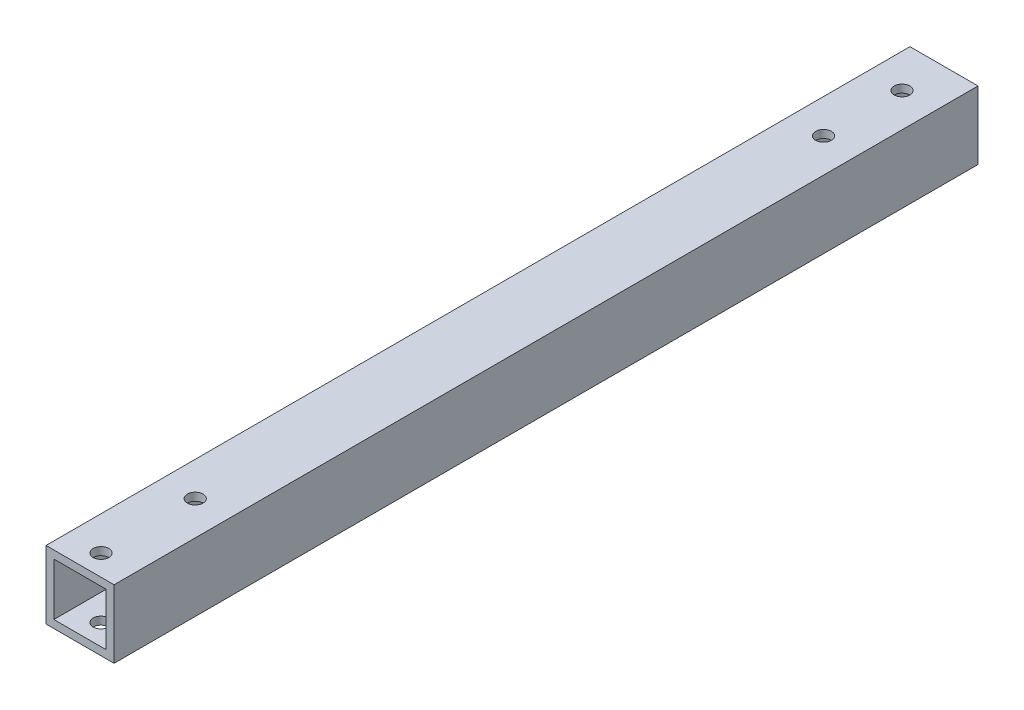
ISO-10303-21;
HEADER;
FILE_DESCRIPTION(('STEP AP214'),'2;1');
FILE_NAME('part.step','',(''),(''),'','','');
FILE_SCHEMA(('AUTOMOTIVE_DESIGN { 1 0 10303 214 1 1 1 1 }'));
ENDSEC;
DATA;
#1=APPLICATION_CONTEXT('core data for automotive mechanical design processes');
#2=APPLICATION_PROTOCOL_DEFINITION('international standard','automotive_design',2000,#1);
#3=PRODUCT_CONTEXT('',#1,'mechanical');
#4=PRODUCT('Part','Part','',(#3));
#5=PRODUCT_RELATED_PRODUCT_CATEGORY('part','',(#4));
#6=PRODUCT_DEFINITION_FORMATION('','',#4);
#7=PRODUCT_DEFINITION_CONTEXT('part definition',#1,'design');
#8=PRODUCT_DEFINITION('design','',#6,#7);
#9=PRODUCT_DEFINITION_SHAPE('','',#8);
#10=(LENGTH_UNIT() NAMED_UNIT(*) SI_UNIT(.MILLI.,.METRE.));
#11=(NAMED_UNIT(*) PLANE_ANGLE_UNIT() SI_UNIT($,.RADIAN.));
#12=(NAMED_UNIT(*) SI_UNIT($,.STERADIAN.) SOLID_ANGLE_UNIT());
#13=UNCERTAINTY_MEASURE_WITH_UNIT(LENGTH_MEASURE(1.E-05),#10,'distance_accuracy_value','');
#14=(GEOMETRIC_REPRESENTATION_CONTEXT(3) GLOBAL_UNCERTAINTY_ASSIGNED_CONTEXT((#13)) GLOBAL_UNIT_ASSIGNED_CONTEXT((#10,
#11,#12)) REPRESENTATION_CONTEXT('',''));
#15=CARTESIAN_POINT('',(0.,0.,0.));
#16=DIRECTION('',(0.,0.,1.));
#17=DIRECTION('',(1.,0.,0.));
#18=AXIS2_PLACEMENT_3D('',#15,#16,#17);
#19=CARTESIAN_POINT('',(6.5,6.5,165.));
#20=DIRECTION('',(-1.,0.,0.));
#21=DIRECTION('',(0.,-1.,0.));
#22=AXIS2_PLACEMENT_3D('',#19,#20,#21);
#23=PLANE('',#22);
#24=DIRECTION('',(0.,1.,0.));
#25=VECTOR('',#24,1.);
#26=CARTESIAN_POINT('',(6.5,6.5,0.));
#27=LINE('',#26,#25);
#28=CARTESIAN_POINT('',(6.5,-6.5,0.));
#29=VERTEX_POINT('',#28);
#30=CARTESIAN_POINT('',(6.5,6.5,0.));
#31=VERTEX_POINT('',#30);
#32=EDGE_CURVE('E148',#29,#31,#27,.T.);
#33=ORIENTED_EDGE('',*,*,#32,.T.);
#34=DIRECTION('',(0.,0.,-1.));
#35=VECTOR('',#34,1.);
#36=CARTESIAN_POINT('',(6.5,6.5,165.));
#37=LINE('',#36,#35);
#38=CARTESIAN_POINT('',(6.5,6.5,165.));
#39=VERTEX_POINT('',#38);
#40=EDGE_CURVE('E11',#39,#31,#37,.T.);
#41=ORIENTED_EDGE('',*,*,#40,.F.);
#42=DIRECTION('',(0.,1.,0.));
#43=VECTOR('',#42,1.);
#44=CARTESIAN_POINT('',(6.5,6.5,165.));
#45=LINE('',#44,#43);
#46=CARTESIAN_POINT('',(6.5,-6.5,165.));
#47=VERTEX_POINT('',#46);
#48=EDGE_CURVE('E137',#47,#39,#45,.T.);
#49=ORIENTED_EDGE('',*,*,#48,.F.);
#50=DIRECTION('',(0.,0.,-1.));
#51=VECTOR('',#50,1.);
#52=CARTESIAN_POINT('',(6.5,-6.5,165.));
#53=LINE('',#52,#51);
#54=EDGE_CURVE('E147',#47,#29,#53,.T.);
#55=ORIENTED_EDGE('',*,*,#54,.T.);
#56=EDGE_LOOP('',(#33,#41,#49,#55));
#57=FACE_BOUND('',#56,.T.);
#58=ADVANCED_FACE('F37',(#57),#23,.F.);
#59=CARTESIAN_POINT('',(-6.5,6.5,165.));
#60=DIRECTION('',(0.,-1.,0.));
#61=DIRECTION('',(0.,0.,-1.));
#62=AXIS2_PLACEMENT_3D('',#59,#60,#61);
#63=PLANE('',#62);
#64=CARTESIAN_POINT('',(0.,6.5,143.));
#65=DIRECTION('',(0.,1.,0.));
#66=DIRECTION('',(0.,0.,1.));
#67=AXIS2_PLACEMENT_3D('',#64,#65,#66);
#68=CIRCLE('',#67,1.5);
#69=CARTESIAN_POINT('',(0.,6.5,144.5));
#70=VERTEX_POINT('',#69);
#71=EDGE_CURVE('E311',#70,#70,#68,.T.);
#72=ORIENTED_EDGE('',*,*,#71,.F.);
#73=EDGE_LOOP('',(#72));
#74=FACE_BOUND('',#73,.T.);
#75=CARTESIAN_POINT('',(0.,6.5,161.));
#76=DIRECTION('',(0.,1.,0.));
#77=DIRECTION('',(0.,0.,1.));
#78=AXIS2_PLACEMENT_3D('',#75,#76,#77);
#79=CIRCLE('',#78,1.5);
#80=CARTESIAN_POINT('',(0.,6.5,162.5));
#81=VERTEX_POINT('',#80);
#82=EDGE_CURVE('E181',#81,#81,#79,.T.);
#83=ORIENTED_EDGE('',*,*,#82,.F.);
#84=EDGE_LOOP('',(#83));
#85=FACE_BOUND('',#84,.T.);
#86=CARTESIAN_POINT('',(0.,6.5,23.));
#87=DIRECTION('',(0.,1.,0.));
#88=DIRECTION('',(0.,0.,1.));
#89=AXIS2_PLACEMENT_3D('',#86,#87,#88);
#90=CIRCLE('',#89,1.5);
#91=CARTESIAN_POINT('',(0.,6.5,24.5));
#92=VERTEX_POINT('',#91);
#93=EDGE_CURVE('E178',#92,#92,#90,.T.);
#94=ORIENTED_EDGE('',*,*,#93,.F.);
#95=EDGE_LOOP('',(#94));
#96=FACE_BOUND('',#95,.T.);
#97=CARTESIAN_POINT('',(0.,6.5,8.));
#98=DIRECTION('',(0.,1.,0.));
#99=DIRECTION('',(0.,0.,1.));
#100=AXIS2_PLACEMENT_3D('',#97,#98,#99);
#101=CIRCLE('',#100,1.5);
#102=CARTESIAN_POINT('',(0.,6.5,9.5));
#103=VERTEX_POINT('',#102);
#104=EDGE_CURVE('E197',#103,#103,#101,.T.);
#105=ORIENTED_EDGE('',*,*,#104,.F.);
#106=EDGE_LOOP('',(#105));
#107=FACE_BOUND('',#106,.T.);
#108=DIRECTION('',(-1.,0.,0.));
#109=VECTOR('',#108,1.);
#110=CARTESIAN_POINT('',(-6.5,6.5,0.));
#111=LINE('',#110,#109);
#112=CARTESIAN_POINT('',(-6.5,6.5,0.));
#113=VERTEX_POINT('',#112);
#114=EDGE_CURVE('E151',#31,#113,#111,.T.);
#115=ORIENTED_EDGE('',*,*,#114,.T.);
#116=DIRECTION('',(0.,0.,-1.));
#117=VECTOR('',#116,1.);
#118=CARTESIAN_POINT('',(-6.5,6.5,165.));
#119=LINE('',#118,#117);
#120=CARTESIAN_POINT('',(-6.5,6.5,165.));
#121=VERTEX_POINT('',#120);
#122=EDGE_CURVE('E45',#121,#113,#119,.T.);
#123=ORIENTED_EDGE('',*,*,#122,.F.);
#124=DIRECTION('',(-1.,0.,0.));
#125=VECTOR('',#124,1.);
#126=CARTESIAN_POINT('',(-6.5,6.5,165.));
#127=LINE('',#126,#125);
#128=EDGE_CURVE('E140',#39,#121,#127,.T.);
#129=ORIENTED_EDGE('',*,*,#128,.F.);
#130=ORIENTED_EDGE('',*,*,#40,.T.);
#131=EDGE_LOOP('',(#115,#123,#129,#130));
#132=FACE_BOUND('',#131,.T.);
#133=ADVANCED_FACE('F226',(#74,#85,#96,#107,#132),#63,.F.);
#134=CARTESIAN_POINT('',(-6.5,6.5,165.));
#135=DIRECTION('',(1.,0.,0.));
#136=DIRECTION('',(0.,1.,0.));
#137=AXIS2_PLACEMENT_3D('',#134,#135,#136);
#138=PLANE('',#137);
#139=DIRECTION('',(0.,-1.,0.));
#140=VECTOR('',#139,1.);
#141=CARTESIAN_POINT('',(-6.5,6.5,0.));
#142=LINE('',#141,#140);
#143=CARTESIAN_POINT('',(-6.5,-6.5,0.));
#144=VERTEX_POINT('',#143);
#145=EDGE_CURVE('E153',#113,#144,#142,.T.);
#146=ORIENTED_EDGE('',*,*,#145,.T.);
#147=DIRECTION('',(0.,0.,-1.));
#148=VECTOR('',#147,1.);
#149=CARTESIAN_POINT('',(-6.5,-6.5,165.));
#150=LINE('',#149,#148);
#151=CARTESIAN_POINT('',(-6.5,-6.5,165.));
#152=VERTEX_POINT('',#151);
#153=EDGE_CURVE('E158',#152,#144,#150,.T.);
#154=ORIENTED_EDGE('',*,*,#153,.F.);
#155=DIRECTION('',(0.,-1.,0.));
#156=VECTOR('',#155,1.);
#157=CARTESIAN_POINT('',(-6.5,6.5,165.));
#158=LINE('',#157,#156);
#159=EDGE_CURVE('E143',#121,#152,#158,.T.);
#160=ORIENTED_EDGE('',*,*,#159,.F.);
#161=ORIENTED_EDGE('',*,*,#122,.T.);
#162=EDGE_LOOP('',(#146,#154,#160,#161));
#163=FACE_BOUND('',#162,.T.);
#164=ADVANCED_FACE('F231',(#163),#138,.F.);
#165=CARTESIAN_POINT('',(-6.5,-6.5,165.));
#166=DIRECTION('',(0.,1.,0.));
#167=DIRECTION('',(0.,0.,1.));
#168=AXIS2_PLACEMENT_3D('',#165,#166,#167);
#169=PLANE('',#168);
#170=CARTESIAN_POINT('',(0.,-6.5,143.));
#171=DIRECTION('',(0.,1.,0.));
#172=DIRECTION('',(0.,0.,1.));
#173=AXIS2_PLACEMENT_3D('',#170,#171,#172);
#174=CIRCLE('',#173,1.5);
#175=CARTESIAN_POINT('',(0.,-6.5,144.5));
#176=VERTEX_POINT('',#175);
#177=EDGE_CURVE('E310',#176,#176,#174,.T.);
#178=ORIENTED_EDGE('',*,*,#177,.T.);
#179=EDGE_LOOP('',(#178));
#180=FACE_BOUND('',#179,.T.);
#181=CARTESIAN_POINT('',(0.,-6.5,161.));
#182=DIRECTION('',(0.,1.,0.));
#183=DIRECTION('',(0.,0.,1.));
#184=AXIS2_PLACEMENT_3D('',#181,#182,#183);
#185=CIRCLE('',#184,1.5);
#186=CARTESIAN_POINT('',(0.,-6.5,162.5));
#187=VERTEX_POINT('',#186);
#188=EDGE_CURVE('E174',#187,#187,#185,.T.);
#189=ORIENTED_EDGE('',*,*,#188,.T.);
#190=EDGE_LOOP('',(#189));
#191=FACE_BOUND('',#190,.T.);
#192=CARTESIAN_POINT('',(0.,-6.5,23.));
#193=DIRECTION('',(0.,1.,0.));
#194=DIRECTION('',(0.,0.,1.));
#195=AXIS2_PLACEMENT_3D('',#192,#193,#194);
#196=CIRCLE('',#195,1.5);
#197=CARTESIAN_POINT('',(0.,-6.5,24.5));
#198=VERTEX_POINT('',#197);
#199=EDGE_CURVE('E170',#198,#198,#196,.T.);
#200=ORIENTED_EDGE('',*,*,#199,.T.);
#201=EDGE_LOOP('',(#200));
#202=FACE_BOUND('',#201,.T.);
#203=CARTESIAN_POINT('',(0.,-6.5,8.));
#204=DIRECTION('',(0.,1.,0.));
#205=DIRECTION('',(0.,0.,1.));
#206=AXIS2_PLACEMENT_3D('',#203,#204,#205);
#207=CIRCLE('',#206,1.5);
#208=CARTESIAN_POINT('',(0.,-6.5,9.5));
#209=VERTEX_POINT('',#208);
#210=EDGE_CURVE('E166',#209,#209,#207,.T.);
#211=ORIENTED_EDGE('',*,*,#210,.T.);
#212=EDGE_LOOP('',(#211));
#213=FACE_BOUND('',#212,.T.);
#214=DIRECTION('',(1.,0.,0.));
#215=VECTOR('',#214,1.);
#216=CARTESIAN_POINT('',(-6.5,-6.5,0.));
#217=LINE('',#216,#215);
#218=EDGE_CURVE('E141',#144,#29,#217,.T.);
#219=ORIENTED_EDGE('',*,*,#218,.T.);
#220=ORIENTED_EDGE('',*,*,#54,.F.);
#221=DIRECTION('',(1.,0.,0.));
#222=VECTOR('',#221,1.);
#223=CARTESIAN_POINT('',(-6.5,-6.5,165.));
#224=LINE('',#223,#222);
#225=EDGE_CURVE('E145',#152,#47,#224,.T.);
#226=ORIENTED_EDGE('',*,*,#225,.F.);
#227=ORIENTED_EDGE('',*,*,#153,.T.);
#228=EDGE_LOOP('',(#219,#220,#226,#227));
#229=FACE_BOUND('',#228,.T.);
#230=ADVANCED_FACE('F245',(#180,#191,#202,#213,#229),#169,.F.);
#231=CARTESIAN_POINT('',(0.,0.,165.));
#232=DIRECTION('',(0.,0.,1.));
#233=DIRECTION('',(1.,0.,0.));
#234=AXIS2_PLACEMENT_3D('',#231,#232,#233);
#235=PLANE('',#234);
#236=DIRECTION('',(0.,1.,0.));
#237=VECTOR('',#236,1.);
#238=CARTESIAN_POINT('',(5.,6.5,165.));
#239=LINE('',#238,#237);
#240=CARTESIAN_POINT('',(5.,-5.,165.));
#241=VERTEX_POINT('',#240);
#242=CARTESIAN_POINT('',(5.,5.,165.));
#243=VERTEX_POINT('',#242);
#244=EDGE_CURVE('E125',#241,#243,#239,.T.);
#245=ORIENTED_EDGE('',*,*,#244,.F.);
#246=DIRECTION('',(1.,0.,0.));
#247=VECTOR('',#246,1.);
#248=CARTESIAN_POINT('',(-6.5,-5.,165.));
#249=LINE('',#248,#247);
#250=CARTESIAN_POINT('',(-5.,-5.,165.));
#251=VERTEX_POINT('',#250);
#252=EDGE_CURVE('E108',#251,#241,#249,.T.);
#253=ORIENTED_EDGE('',*,*,#252,.F.);
#254=DIRECTION('',(0.,-1.,0.));
#255=VECTOR('',#254,1.);
#256=CARTESIAN_POINT('',(-5.,6.5,165.));
#257=LINE('',#256,#255);
#258=CARTESIAN_POINT('',(-5.,5.,165.));
#259=VERTEX_POINT('',#258);
#260=EDGE_CURVE('E134',#259,#251,#257,.T.);
#261=ORIENTED_EDGE('',*,*,#260,.F.);
#262=DIRECTION('',(-1.,0.,0.));
#263=VECTOR('',#262,1.);
#264=CARTESIAN_POINT('',(-6.5,5.,165.));
#265=LINE('',#264,#263);
#266=EDGE_CURVE('E127',#243,#259,#265,.T.);
#267=ORIENTED_EDGE('',*,*,#266,.F.);
#268=EDGE_LOOP('',(#245,#253,#261,#267));
#269=FACE_BOUND('',#268,.T.);
#270=ORIENTED_EDGE('',*,*,#48,.T.);
#271=ORIENTED_EDGE('',*,*,#128,.T.);
#272=ORIENTED_EDGE('',*,*,#159,.T.);
#273=ORIENTED_EDGE('',*,*,#225,.T.);
#274=EDGE_LOOP('',(#270,#271,#272,#273));
#275=FACE_BOUND('',#274,.T.);
#276=ADVANCED_FACE('F210',(#269,#275),#235,.T.);
#277=CARTESIAN_POINT('',(0.,0.,0.));
#278=DIRECTION('',(0.,0.,1.));
#279=DIRECTION('',(1.,0.,0.));
#280=AXIS2_PLACEMENT_3D('',#277,#278,#279);
#281=PLANE('',#280);
#282=DIRECTION('',(1.,0.,0.));
#283=VECTOR('',#282,1.);
#284=CARTESIAN_POINT('',(-6.5,-5.,0.));
#285=LINE('',#284,#283);
#286=CARTESIAN_POINT('',(-5.,-5.,0.));
#287=VERTEX_POINT('',#286);
#288=CARTESIAN_POINT('',(5.,-5.,0.));
#289=VERTEX_POINT('',#288);
#290=EDGE_CURVE('E106',#287,#289,#285,.T.);
#291=ORIENTED_EDGE('',*,*,#290,.T.);
#292=DIRECTION('',(0.,1.,0.));
#293=VECTOR('',#292,1.);
#294=CARTESIAN_POINT('',(5.,6.5,0.));
#295=LINE('',#294,#293);
#296=CARTESIAN_POINT('',(5.,5.,0.));
#297=VERTEX_POINT('',#296);
#298=EDGE_CURVE('E114',#289,#297,#295,.T.);
#299=ORIENTED_EDGE('',*,*,#298,.T.);
#300=DIRECTION('',(-1.,0.,0.));
#301=VECTOR('',#300,1.);
#302=CARTESIAN_POINT('',(-6.5,5.,0.));
#303=LINE('',#302,#301);
#304=CARTESIAN_POINT('',(-5.,5.,0.));
#305=VERTEX_POINT('',#304);
#306=EDGE_CURVE('E120',#297,#305,#303,.T.);
#307=ORIENTED_EDGE('',*,*,#306,.T.);
#308=DIRECTION('',(0.,-1.,0.));
#309=VECTOR('',#308,1.);
#310=CARTESIAN_POINT('',(-5.,6.5,0.));
#311=LINE('',#310,#309);
#312=EDGE_CURVE('E60',#305,#287,#311,.T.);
#313=ORIENTED_EDGE('',*,*,#312,.T.);
#314=EDGE_LOOP('',(#291,#299,#307,#313));
#315=FACE_BOUND('',#314,.T.);
#316=ORIENTED_EDGE('',*,*,#32,.F.);
#317=ORIENTED_EDGE('',*,*,#218,.F.);
#318=ORIENTED_EDGE('',*,*,#145,.F.);
#319=ORIENTED_EDGE('',*,*,#114,.F.);
#320=EDGE_LOOP('',(#316,#317,#318,#319));
#321=FACE_BOUND('',#320,.T.);
#322=ADVANCED_FACE('F123',(#315,#321),#281,.F.);
#323=CARTESIAN_POINT('',(5.,6.5,165.));
#324=DIRECTION('',(-1.,0.,0.));
#325=DIRECTION('',(0.,-1.,0.));
#326=AXIS2_PLACEMENT_3D('',#323,#324,#325);
#327=PLANE('',#326);
#328=ORIENTED_EDGE('',*,*,#298,.F.);
#329=DIRECTION('',(0.,0.,-1.));
#330=VECTOR('',#329,1.);
#331=CARTESIAN_POINT('',(5.,-5.,165.));
#332=LINE('',#331,#330);
#333=EDGE_CURVE('E102',#241,#289,#332,.T.);
#334=ORIENTED_EDGE('',*,*,#333,.F.);
#335=ORIENTED_EDGE('',*,*,#244,.T.);
#336=DIRECTION('',(0.,0.,-1.));
#337=VECTOR('',#336,1.);
#338=CARTESIAN_POINT('',(5.,5.,165.));
#339=LINE('',#338,#337);
#340=EDGE_CURVE('E117',#243,#297,#339,.T.);
#341=ORIENTED_EDGE('',*,*,#340,.T.);
#342=EDGE_LOOP('',(#328,#334,#335,#341));
#343=FACE_BOUND('',#342,.T.);
#344=ADVANCED_FACE('F115',(#343),#327,.T.);
#345=CARTESIAN_POINT('',(-6.5,5.,165.));
#346=DIRECTION('',(0.,-1.,0.));
#347=DIRECTION('',(0.,0.,-1.));
#348=AXIS2_PLACEMENT_3D('',#345,#346,#347);
#349=PLANE('',#348);
#350=CARTESIAN_POINT('',(0.,5.,143.));
#351=DIRECTION('',(0.,-1.,0.));
#352=DIRECTION('',(0.,0.,-1.));
#353=AXIS2_PLACEMENT_3D('',#350,#351,#352);
#354=CIRCLE('',#353,1.5);
#355=CARTESIAN_POINT('',(0.,5.,144.5));
#356=VERTEX_POINT('',#355);
#357=EDGE_CURVE('E186',#356,#356,#354,.T.);
#358=ORIENTED_EDGE('',*,*,#357,.F.);
#359=EDGE_LOOP('',(#358));
#360=FACE_BOUND('',#359,.T.);
#361=CARTESIAN_POINT('',(0.,5.,161.));
#362=DIRECTION('',(0.,-1.,0.));
#363=DIRECTION('',(0.,0.,-1.));
#364=AXIS2_PLACEMENT_3D('',#361,#362,#363);
#365=CIRCLE('',#364,1.5);
#366=CARTESIAN_POINT('',(0.,5.,162.5));
#367=VERTEX_POINT('',#366);
#368=EDGE_CURVE('E173',#367,#367,#365,.T.);
#369=ORIENTED_EDGE('',*,*,#368,.F.);
#370=EDGE_LOOP('',(#369));
#371=FACE_BOUND('',#370,.T.);
#372=CARTESIAN_POINT('',(0.,5.,23.));
#373=DIRECTION('',(0.,-1.,0.));
#374=DIRECTION('',(0.,0.,-1.));
#375=AXIS2_PLACEMENT_3D('',#372,#373,#374);
#376=CIRCLE('',#375,1.5);
#377=CARTESIAN_POINT('',(0.,5.,24.5));
#378=VERTEX_POINT('',#377);
#379=EDGE_CURVE('E169',#378,#378,#376,.T.);
#380=ORIENTED_EDGE('',*,*,#379,.F.);
#381=EDGE_LOOP('',(#380));
#382=FACE_BOUND('',#381,.T.);
#383=CARTESIAN_POINT('',(0.,5.,8.));
#384=DIRECTION('',(0.,-1.,0.));
#385=DIRECTION('',(0.,0.,-1.));
#386=AXIS2_PLACEMENT_3D('',#383,#384,#385);
#387=CIRCLE('',#386,1.5);
#388=CARTESIAN_POINT('',(0.,5.,9.5));
#389=VERTEX_POINT('',#388);
#390=EDGE_CURVE('E121',#389,#389,#387,.T.);
#391=ORIENTED_EDGE('',*,*,#390,.F.);
#392=EDGE_LOOP('',(#391));
#393=FACE_BOUND('',#392,.T.);
#394=ORIENTED_EDGE('',*,*,#306,.F.);
#395=ORIENTED_EDGE('',*,*,#340,.F.);
#396=ORIENTED_EDGE('',*,*,#266,.T.);
#397=DIRECTION('',(0.,0.,-1.));
#398=VECTOR('',#397,1.);
#399=CARTESIAN_POINT('',(-5.,5.,165.));
#400=LINE('',#399,#398);
#401=EDGE_CURVE('E204',#259,#305,#400,.T.);
#402=ORIENTED_EDGE('',*,*,#401,.T.);
#403=EDGE_LOOP('',(#394,#395,#396,#402));
#404=FACE_BOUND('',#403,.T.);
#405=ADVANCED_FACE('F213',(#360,#371,#382,#393,#404),#349,.T.);
#406=CARTESIAN_POINT('',(-5.,6.5,165.));
#407=DIRECTION('',(1.,0.,0.));
#408=DIRECTION('',(0.,1.,0.));
#409=AXIS2_PLACEMENT_3D('',#406,#407,#408);
#410=PLANE('',#409);
#411=ORIENTED_EDGE('',*,*,#312,.F.);
#412=ORIENTED_EDGE('',*,*,#401,.F.);
#413=ORIENTED_EDGE('',*,*,#260,.T.);
#414=DIRECTION('',(0.,0.,-1.));
#415=VECTOR('',#414,1.);
#416=CARTESIAN_POINT('',(-5.,-5.,165.));
#417=LINE('',#416,#415);
#418=EDGE_CURVE('E53',#251,#287,#417,.T.);
#419=ORIENTED_EDGE('',*,*,#418,.T.);
#420=EDGE_LOOP('',(#411,#412,#413,#419));
#421=FACE_BOUND('',#420,.T.);
#422=ADVANCED_FACE('F206',(#421),#410,.T.);
#423=CARTESIAN_POINT('',(-6.5,-5.,165.));
#424=DIRECTION('',(0.,1.,0.));
#425=DIRECTION('',(0.,0.,1.));
#426=AXIS2_PLACEMENT_3D('',#423,#424,#425);
#427=PLANE('',#426);
#428=CARTESIAN_POINT('',(0.,-5.,143.));
#429=DIRECTION('',(0.,1.,0.));
#430=DIRECTION('',(0.,0.,1.));
#431=AXIS2_PLACEMENT_3D('',#428,#429,#430);
#432=CIRCLE('',#431,1.5);
#433=CARTESIAN_POINT('',(0.,-5.,144.5));
#434=VERTEX_POINT('',#433);
#435=EDGE_CURVE('E40',#434,#434,#432,.T.);
#436=ORIENTED_EDGE('',*,*,#435,.F.);
#437=EDGE_LOOP('',(#436));
#438=FACE_BOUND('',#437,.T.);
#439=CARTESIAN_POINT('',(0.,-5.,161.));
#440=DIRECTION('',(0.,1.,0.));
#441=DIRECTION('',(0.,0.,1.));
#442=AXIS2_PLACEMENT_3D('',#439,#440,#441);
#443=CIRCLE('',#442,1.5);
#444=CARTESIAN_POINT('',(0.,-5.,162.5));
#445=VERTEX_POINT('',#444);
#446=EDGE_CURVE('E171',#445,#445,#443,.T.);
#447=ORIENTED_EDGE('',*,*,#446,.F.);
#448=EDGE_LOOP('',(#447));
#449=FACE_BOUND('',#448,.T.);
#450=CARTESIAN_POINT('',(0.,-5.,23.));
#451=DIRECTION('',(0.,1.,0.));
#452=DIRECTION('',(0.,0.,1.));
#453=AXIS2_PLACEMENT_3D('',#450,#451,#452);
#454=CIRCLE('',#453,1.5);
#455=CARTESIAN_POINT('',(0.,-5.,24.5));
#456=VERTEX_POINT('',#455);
#457=EDGE_CURVE('E167',#456,#456,#454,.T.);
#458=ORIENTED_EDGE('',*,*,#457,.F.);
#459=EDGE_LOOP('',(#458));
#460=FACE_BOUND('',#459,.T.);
#461=CARTESIAN_POINT('',(0.,-5.,8.));
#462=DIRECTION('',(0.,1.,0.));
#463=DIRECTION('',(0.,0.,1.));
#464=AXIS2_PLACEMENT_3D('',#461,#462,#463);
#465=CIRCLE('',#464,1.5);
#466=CARTESIAN_POINT('',(0.,-5.,9.5));
#467=VERTEX_POINT('',#466);
#468=EDGE_CURVE('E163',#467,#467,#465,.T.);
#469=ORIENTED_EDGE('',*,*,#468,.F.);
#470=EDGE_LOOP('',(#469));
#471=FACE_BOUND('',#470,.T.);
#472=ORIENTED_EDGE('',*,*,#290,.F.);
#473=ORIENTED_EDGE('',*,*,#418,.F.);
#474=ORIENTED_EDGE('',*,*,#252,.T.);
#475=ORIENTED_EDGE('',*,*,#333,.T.);
#476=EDGE_LOOP('',(#472,#473,#474,#475));
#477=FACE_BOUND('',#476,.T.);
#478=ADVANCED_FACE('F104',(#438,#449,#460,#471,#477),#427,.T.);
#479=CARTESIAN_POINT('',(0.,-6.5,8.));
#480=DIRECTION('',(0.,1.,0.));
#481=DIRECTION('',(0.,0.,1.));
#482=AXIS2_PLACEMENT_3D('',#479,#480,#481);
#483=CYLINDRICAL_SURFACE('',#482,1.5);
#484=CARTESIAN_POINT('',(0.,-5.,9.5));
#485=CARTESIAN_POINT('',(0.,-5.015625,9.5));
#486=CARTESIAN_POINT('',(0.,-5.03125,9.5));
#487=CARTESIAN_POINT('',(0.,-5.0625,9.5));
#488=CARTESIAN_POINT('',(0.,-5.078125,9.5));
#489=CARTESIAN_POINT('',(0.,-5.109375,9.5));
#490=CARTESIAN_POINT('',(0.,-5.125,9.5));
#491=CARTESIAN_POINT('',(0.,-5.15625,9.5));
#492=CARTESIAN_POINT('',(0.,-5.171875,9.5));
#493=CARTESIAN_POINT('',(0.,-5.203125,9.5));
#494=CARTESIAN_POINT('',(0.,-5.21875,9.5));
#495=CARTESIAN_POINT('',(0.,-5.25,9.5));
#496=CARTESIAN_POINT('',(0.,-5.265625,9.5));
#497=CARTESIAN_POINT('',(0.,-5.296875,9.5));
#498=CARTESIAN_POINT('',(0.,-5.3125,9.5));
#499=CARTESIAN_POINT('',(0.,-5.34375,9.5));
#500=CARTESIAN_POINT('',(0.,-5.359375,9.5));
#501=CARTESIAN_POINT('',(0.,-5.390625,9.5));
#502=CARTESIAN_POINT('',(0.,-5.40625,9.5));
#503=CARTESIAN_POINT('',(0.,-5.4375,9.5));
#504=CARTESIAN_POINT('',(0.,-5.453125,9.5));
#505=CARTESIAN_POINT('',(0.,-5.484375,9.5));
#506=CARTESIAN_POINT('',(0.,-5.5,9.5));
#507=CARTESIAN_POINT('',(0.,-5.53125,9.5));
#508=CARTESIAN_POINT('',(0.,-5.546875,9.5));
#509=CARTESIAN_POINT('',(0.,-5.578125,9.5));
#510=CARTESIAN_POINT('',(0.,-5.59375,9.5));
#511=CARTESIAN_POINT('',(0.,-5.625,9.5));
#512=CARTESIAN_POINT('',(0.,-5.640625,9.5));
#513=CARTESIAN_POINT('',(0.,-5.671875,9.5));
#514=CARTESIAN_POINT('',(0.,-5.6875,9.5));
#515=CARTESIAN_POINT('',(0.,-5.71875,9.5));
#516=CARTESIAN_POINT('',(0.,-5.734375,9.5));
#517=CARTESIAN_POINT('',(0.,-5.765625,9.5));
#518=CARTESIAN_POINT('',(0.,-5.78125,9.5));
#519=CARTESIAN_POINT('',(0.,-5.8125,9.5));
#520=CARTESIAN_POINT('',(0.,-5.828125,9.5));
#521=CARTESIAN_POINT('',(0.,-5.859375,9.5));
#522=CARTESIAN_POINT('',(0.,-5.875,9.5));
#523=CARTESIAN_POINT('',(0.,-5.90625,9.5));
#524=CARTESIAN_POINT('',(0.,-5.921875,9.5));
#525=CARTESIAN_POINT('',(0.,-5.953125,9.5));
#526=CARTESIAN_POINT('',(0.,-5.96875,9.5));
#527=CARTESIAN_POINT('',(0.,-6.,9.5));
#528=CARTESIAN_POINT('',(0.,-6.015625,9.5));
#529=CARTESIAN_POINT('',(0.,-6.046875,9.5));
#530=CARTESIAN_POINT('',(0.,-6.0625,9.5));
#531=CARTESIAN_POINT('',(0.,-6.09375,9.5));
#532=CARTESIAN_POINT('',(0.,-6.109375,9.5));
#533=CARTESIAN_POINT('',(0.,-6.140625,9.5));
#534=CARTESIAN_POINT('',(0.,-6.15625,9.5));
#535=CARTESIAN_POINT('',(0.,-6.1875,9.5));
#536=CARTESIAN_POINT('',(0.,-6.203125,9.5));
#537=CARTESIAN_POINT('',(0.,-6.234375,9.5));
#538=CARTESIAN_POINT('',(0.,-6.25,9.5));
#539=CARTESIAN_POINT('',(0.,-6.28125,9.5));
#540=CARTESIAN_POINT('',(0.,-6.296875,9.5));
#541=CARTESIAN_POINT('',(0.,-6.328125,9.5));
#542=CARTESIAN_POINT('',(0.,-6.34375,9.5));
#543=CARTESIAN_POINT('',(0.,-6.375,9.5));
#544=CARTESIAN_POINT('',(0.,-6.390625,9.5));
#545=CARTESIAN_POINT('',(0.,-6.421875,9.5));
#546=CARTESIAN_POINT('',(0.,-6.4375,9.5));
#547=CARTESIAN_POINT('',(0.,-6.46875,9.5));
#548=CARTESIAN_POINT('',(0.,-6.484375,9.5));
#549=CARTESIAN_POINT('',(0.,-6.5,9.5));
#550=B_SPLINE_CURVE_WITH_KNOTS('',3,(#484,#485,#486,#487,#488,#489,#490,#491,#492,#493,#494,
#495,#496,#497,#498,#499,#500,#501,#502,#503,#504,#505,#506,#507,#508,#509,#510,#511,#512,#513,
#514,#515,#516,#517,#518,#519,#520,#521,#522,#523,#524,#525,#526,#527,#528,#529,#530,#531,#532,
#533,#534,#535,#536,#537,#538,#539,#540,#541,#542,#543,#544,#545,#546,#547,#548,#549),
.UNSPECIFIED.,.F.,.F.,(4,2,2,2,2,2,2,2,2,2,2,2,2,2,2,2,2,2,2,2,2,2,2,2,2,2,2,2,2,2,2,2,4),(0.,
0.046875,0.0937500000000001,0.140625,0.1875,0.234374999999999,0.281249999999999,
0.328124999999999,0.374999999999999,0.421875,0.46875,0.515625,0.5625,0.609375,0.65625,0.703125,
0.75,0.796875,0.84375,0.890625,0.9375,0.984375,1.03125,1.078125,1.125,1.171875,1.21875,1.265625,
1.3125,1.359375,1.40625,1.453125,1.5),.UNSPECIFIED.);
#551=EDGE_CURVE('BSEAM260',#467,#209,#550,.T.);
#552=ORIENTED_EDGE('',*,*,#468,.T.);
#553=ORIENTED_EDGE('',*,*,#210,.F.);
#554=ORIENTED_EDGE('',*,*,#551,.T.);
#555=ORIENTED_EDGE('',*,*,#551,.F.);
#556=EDGE_LOOP('',(#552,#554,#553,#555));
#557=FACE_BOUND('',#556,.T.);
#558=ADVANCED_FACE('F260',(#557),#483,.F.);
#559=CARTESIAN_POINT('',(0.,5.,9.5));
#560=CARTESIAN_POINT('',(0.,5.015625,9.5));
#561=CARTESIAN_POINT('',(0.,5.03125,9.5));
#562=CARTESIAN_POINT('',(0.,5.0625,9.5));
#563=CARTESIAN_POINT('',(0.,5.078125,9.5));
#564=CARTESIAN_POINT('',(0.,5.109375,9.5));
#565=CARTESIAN_POINT('',(0.,5.125,9.5));
#566=CARTESIAN_POINT('',(0.,5.15625,9.5));
#567=CARTESIAN_POINT('',(0.,5.171875,9.5));
#568=CARTESIAN_POINT('',(0.,5.203125,9.5));
#569=CARTESIAN_POINT('',(0.,5.21875,9.5));
#570=CARTESIAN_POINT('',(0.,5.25,9.5));
#571=CARTESIAN_POINT('',(0.,5.265625,9.5));
#572=CARTESIAN_POINT('',(0.,5.296875,9.5));
#573=CARTESIAN_POINT('',(0.,5.3125,9.5));
#574=CARTESIAN_POINT('',(0.,5.34375,9.5));
#575=CARTESIAN_POINT('',(0.,5.359375,9.5));
#576=CARTESIAN_POINT('',(0.,5.390625,9.5));
#577=CARTESIAN_POINT('',(0.,5.40625,9.5));
#578=CARTESIAN_POINT('',(0.,5.4375,9.5));
#579=CARTESIAN_POINT('',(0.,5.453125,9.5));
#580=CARTESIAN_POINT('',(0.,5.484375,9.5));
#581=CARTESIAN_POINT('',(0.,5.5,9.5));
#582=CARTESIAN_POINT('',(0.,5.53125,9.5));
#583=CARTESIAN_POINT('',(0.,5.546875,9.5));
#584=CARTESIAN_POINT('',(0.,5.578125,9.5));
#585=CARTESIAN_POINT('',(0.,5.59375,9.5));
#586=CARTESIAN_POINT('',(0.,5.625,9.5));
#587=CARTESIAN_POINT('',(0.,5.640625,9.5));
#588=CARTESIAN_POINT('',(0.,5.671875,9.5));
#589=CARTESIAN_POINT('',(0.,5.6875,9.5));
#590=CARTESIAN_POINT('',(0.,5.71875,9.5));
#591=CARTESIAN_POINT('',(0.,5.734375,9.5));
#592=CARTESIAN_POINT('',(0.,5.765625,9.5));
#593=CARTESIAN_POINT('',(0.,5.78125,9.5));
#594=CARTESIAN_POINT('',(0.,5.8125,9.5));
#595=CARTESIAN_POINT('',(0.,5.828125,9.5));
#596=CARTESIAN_POINT('',(0.,5.859375,9.5));
#597=CARTESIAN_POINT('',(0.,5.875,9.5));
#598=CARTESIAN_POINT('',(0.,5.90625,9.5));
#599=CARTESIAN_POINT('',(0.,5.921875,9.5));
#600=CARTESIAN_POINT('',(0.,5.953125,9.5));
#601=CARTESIAN_POINT('',(0.,5.96875,9.5));
#602=CARTESIAN_POINT('',(0.,6.,9.5));
#603=CARTESIAN_POINT('',(0.,6.015625,9.5));
#604=CARTESIAN_POINT('',(0.,6.046875,9.5));
#605=CARTESIAN_POINT('',(0.,6.0625,9.5));
#606=CARTESIAN_POINT('',(0.,6.09375,9.5));
#607=CARTESIAN_POINT('',(0.,6.109375,9.5));
#608=CARTESIAN_POINT('',(0.,6.140625,9.5));
#609=CARTESIAN_POINT('',(0.,6.15625,9.5));
#610=CARTESIAN_POINT('',(0.,6.1875,9.5));
#611=CARTESIAN_POINT('',(0.,6.203125,9.5));
#612=CARTESIAN_POINT('',(0.,6.234375,9.5));
#613=CARTESIAN_POINT('',(0.,6.25,9.5));
#614=CARTESIAN_POINT('',(0.,6.28125,9.5));
#615=CARTESIAN_POINT('',(0.,6.296875,9.5));
#616=CARTESIAN_POINT('',(0.,6.328125,9.5));
#617=CARTESIAN_POINT('',(0.,6.34375,9.5));
#618=CARTESIAN_POINT('',(0.,6.375,9.5));
#619=CARTESIAN_POINT('',(0.,6.390625,9.5));
#620=CARTESIAN_POINT('',(0.,6.421875,9.5));
#621=CARTESIAN_POINT('',(0.,6.4375,9.5));
#622=CARTESIAN_POINT('',(0.,6.46875,9.5));
#623=CARTESIAN_POINT('',(0.,6.484375,9.5));
#624=CARTESIAN_POINT('',(0.,6.5,9.5));
#625=B_SPLINE_CURVE_WITH_KNOTS('',3,(#559,#560,#561,#562,#563,#564,#565,#566,#567,#568,#569,
#570,#571,#572,#573,#574,#575,#576,#577,#578,#579,#580,#581,#582,#583,#584,#585,#586,#587,#588,
#589,#590,#591,#592,#593,#594,#595,#596,#597,#598,#599,#600,#601,#602,#603,#604,#605,#606,#607,
#608,#609,#610,#611,#612,#613,#614,#615,#616,#617,#618,#619,#620,#621,#622,#623,#624),
.UNSPECIFIED.,.F.,.F.,(4,2,2,2,2,2,2,2,2,2,2,2,2,2,2,2,2,2,2,2,2,2,2,2,2,2,2,2,2,2,2,2,4),(0.,
0.046875,0.0937500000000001,0.140625,0.1875,0.234375,0.28125,0.328125,0.375,0.421874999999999,
0.468749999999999,0.515624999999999,0.562499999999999,0.609374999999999,0.656249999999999,
0.703124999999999,0.749999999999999,0.796874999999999,0.843749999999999,0.890624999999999,
0.937499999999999,0.984374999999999,1.03125,1.078125,1.125,1.171875,1.21875,1.265625,1.3125,
1.359375,1.40625,1.453125,1.5),.UNSPECIFIED.);
#626=EDGE_CURVE('BSEAM265',#389,#103,#625,.T.);
#627=ORIENTED_EDGE('',*,*,#390,.T.);
#628=ORIENTED_EDGE('',*,*,#104,.T.);
#629=ORIENTED_EDGE('',*,*,#626,.T.);
#630=ORIENTED_EDGE('',*,*,#626,.F.);
#631=EDGE_LOOP('',(#627,#629,#628,#630));
#632=FACE_BOUND('',#631,.T.);
#633=ADVANCED_FACE('F265',(#632),#483,.F.);
#634=CARTESIAN_POINT('',(0.,-6.5,23.));
#635=DIRECTION('',(0.,1.,0.));
#636=DIRECTION('',(0.,0.,1.));
#637=AXIS2_PLACEMENT_3D('',#634,#635,#636);
#638=CYLINDRICAL_SURFACE('',#637,1.5);
#639=CARTESIAN_POINT('',(0.,-5.,24.5));
#640=CARTESIAN_POINT('',(0.,-5.015625,24.5));
#641=CARTESIAN_POINT('',(0.,-5.03125,24.5));
#642=CARTESIAN_POINT('',(0.,-5.0625,24.5));
#643=CARTESIAN_POINT('',(0.,-5.078125,24.5));
#644=CARTESIAN_POINT('',(0.,-5.109375,24.5));
#645=CARTESIAN_POINT('',(0.,-5.125,24.5));
#646=CARTESIAN_POINT('',(0.,-5.15625,24.5));
#647=CARTESIAN_POINT('',(0.,-5.171875,24.5));
#648=CARTESIAN_POINT('',(0.,-5.203125,24.5));
#649=CARTESIAN_POINT('',(0.,-5.21875,24.5));
#650=CARTESIAN_POINT('',(0.,-5.25,24.5));
#651=CARTESIAN_POINT('',(0.,-5.265625,24.5));
#652=CARTESIAN_POINT('',(0.,-5.296875,24.5));
#653=CARTESIAN_POINT('',(0.,-5.3125,24.5));
#654=CARTESIAN_POINT('',(0.,-5.34375,24.5));
#655=CARTESIAN_POINT('',(0.,-5.359375,24.5));
#656=CARTESIAN_POINT('',(0.,-5.390625,24.5));
#657=CARTESIAN_POINT('',(0.,-5.40625,24.5));
#658=CARTESIAN_POINT('',(0.,-5.4375,24.5));
#659=CARTESIAN_POINT('',(0.,-5.453125,24.5));
#660=CARTESIAN_POINT('',(0.,-5.484375,24.5));
#661=CARTESIAN_POINT('',(0.,-5.5,24.5));
#662=CARTESIAN_POINT('',(0.,-5.53125,24.5));
#663=CARTESIAN_POINT('',(0.,-5.546875,24.5));
#664=CARTESIAN_POINT('',(0.,-5.578125,24.5));
#665=CARTESIAN_POINT('',(0.,-5.59375,24.5));
#666=CARTESIAN_POINT('',(0.,-5.625,24.5));
#667=CARTESIAN_POINT('',(0.,-5.640625,24.5));
#668=CARTESIAN_POINT('',(0.,-5.671875,24.5));
#669=CARTESIAN_POINT('',(0.,-5.6875,24.5));
#670=CARTESIAN_POINT('',(0.,-5.71875,24.5));
#671=CARTESIAN_POINT('',(0.,-5.734375,24.5));
#672=CARTESIAN_POINT('',(0.,-5.765625,24.5));
#673=CARTESIAN_POINT('',(0.,-5.78125,24.5));
#674=CARTESIAN_POINT('',(0.,-5.8125,24.5));
#675=CARTESIAN_POINT('',(0.,-5.828125,24.5));
#676=CARTESIAN_POINT('',(0.,-5.859375,24.5));
#677=CARTESIAN_POINT('',(0.,-5.875,24.5));
#678=CARTESIAN_POINT('',(0.,-5.90625,24.5));
#679=CARTESIAN_POINT('',(0.,-5.921875,24.5));
#680=CARTESIAN_POINT('',(0.,-5.953125,24.5));
#681=CARTESIAN_POINT('',(0.,-5.96875,24.5));
#682=CARTESIAN_POINT('',(0.,-6.,24.5));
#683=CARTESIAN_POINT('',(0.,-6.015625,24.5));
#684=CARTESIAN_POINT('',(0.,-6.046875,24.5));
#685=CARTESIAN_POINT('',(0.,-6.0625,24.5));
#686=CARTESIAN_POINT('',(0.,-6.09375,24.5));
#687=CARTESIAN_POINT('',(0.,-6.109375,24.5));
#688=CARTESIAN_POINT('',(0.,-6.140625,24.5));
#689=CARTESIAN_POINT('',(0.,-6.15625,24.5));
#690=CARTESIAN_POINT('',(0.,-6.1875,24.5));
#691=CARTESIAN_POINT('',(0.,-6.203125,24.5));
#692=CARTESIAN_POINT('',(0.,-6.234375,24.5));
#693=CARTESIAN_POINT('',(0.,-6.25,24.5));
#694=CARTESIAN_POINT('',(0.,-6.28125,24.5));
#695=CARTESIAN_POINT('',(0.,-6.296875,24.5));
#696=CARTESIAN_POINT('',(0.,-6.328125,24.5));
#697=CARTESIAN_POINT('',(0.,-6.34375,24.5));
#698=CARTESIAN_POINT('',(0.,-6.375,24.5));
#699=CARTESIAN_POINT('',(0.,-6.390625,24.5));
#700=CARTESIAN_POINT('',(0.,-6.421875,24.5));
#701=CARTESIAN_POINT('',(0.,-6.4375,24.5));
#702=CARTESIAN_POINT('',(0.,-6.46875,24.5));
#703=CARTESIAN_POINT('',(0.,-6.484375,24.5));
#704=CARTESIAN_POINT('',(0.,-6.5,24.5));
#705=B_SPLINE_CURVE_WITH_KNOTS('',3,(#639,#640,#641,#642,#643,#644,#645,#646,#647,#648,#649,
#650,#651,#652,#653,#654,#655,#656,#657,#658,#659,#660,#661,#662,#663,#664,#665,#666,#667,#668,
#669,#670,#671,#672,#673,#674,#675,#676,#677,#678,#679,#680,#681,#682,#683,#684,#685,#686,#687,
#688,#689,#690,#691,#692,#693,#694,#695,#696,#697,#698,#699,#700,#701,#702,#703,#704),
.UNSPECIFIED.,.F.,.F.,(4,2,2,2,2,2,2,2,2,2,2,2,2,2,2,2,2,2,2,2,2,2,2,2,2,2,2,2,2,2,2,2,4),(0.,
0.046875,0.0937500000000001,0.140625,0.1875,0.234374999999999,0.281249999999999,
0.328124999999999,0.374999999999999,0.421875,0.46875,0.515625,0.5625,0.609375,0.65625,0.703125,
0.75,0.796875,0.84375,0.890625,0.9375,0.984375,1.03125,1.078125,1.125,1.171875,1.21875,1.265625,
1.3125,1.359375,1.40625,1.453125,1.5),.UNSPECIFIED.);
#706=EDGE_CURVE('BSEAM279',#456,#198,#705,.T.);
#707=ORIENTED_EDGE('',*,*,#457,.T.);
#708=ORIENTED_EDGE('',*,*,#199,.F.);
#709=ORIENTED_EDGE('',*,*,#706,.T.);
#710=ORIENTED_EDGE('',*,*,#706,.F.);
#711=EDGE_LOOP('',(#707,#709,#708,#710));
#712=FACE_BOUND('',#711,.T.);
#713=ADVANCED_FACE('F279',(#712),#638,.F.);
#714=CARTESIAN_POINT('',(0.,5.,24.5));
#715=CARTESIAN_POINT('',(0.,5.015625,24.5));
#716=CARTESIAN_POINT('',(0.,5.03125,24.5));
#717=CARTESIAN_POINT('',(0.,5.0625,24.5));
#718=CARTESIAN_POINT('',(0.,5.078125,24.5));
#719=CARTESIAN_POINT('',(0.,5.109375,24.5));
#720=CARTESIAN_POINT('',(0.,5.125,24.5));
#721=CARTESIAN_POINT('',(0.,5.15625,24.5));
#722=CARTESIAN_POINT('',(0.,5.171875,24.5));
#723=CARTESIAN_POINT('',(0.,5.203125,24.5));
#724=CARTESIAN_POINT('',(0.,5.21875,24.5));
#725=CARTESIAN_POINT('',(0.,5.25,24.5));
#726=CARTESIAN_POINT('',(0.,5.265625,24.5));
#727=CARTESIAN_POINT('',(0.,5.296875,24.5));
#728=CARTESIAN_POINT('',(0.,5.3125,24.5));
#729=CARTESIAN_POINT('',(0.,5.34375,24.5));
#730=CARTESIAN_POINT('',(0.,5.359375,24.5));
#731=CARTESIAN_POINT('',(0.,5.390625,24.5));
#732=CARTESIAN_POINT('',(0.,5.40625,24.5));
#733=CARTESIAN_POINT('',(0.,5.4375,24.5));
#734=CARTESIAN_POINT('',(0.,5.453125,24.5));
#735=CARTESIAN_POINT('',(0.,5.484375,24.5));
#736=CARTESIAN_POINT('',(0.,5.5,24.5));
#737=CARTESIAN_POINT('',(0.,5.53125,24.5));
#738=CARTESIAN_POINT('',(0.,5.546875,24.5));
#739=CARTESIAN_POINT('',(0.,5.578125,24.5));
#740=CARTESIAN_POINT('',(0.,5.59375,24.5));
#741=CARTESIAN_POINT('',(0.,5.625,24.5));
#742=CARTESIAN_POINT('',(0.,5.640625,24.5));
#743=CARTESIAN_POINT('',(0.,5.671875,24.5));
#744=CARTESIAN_POINT('',(0.,5.6875,24.5));
#745=CARTESIAN_POINT('',(0.,5.71875,24.5));
#746=CARTESIAN_POINT('',(0.,5.734375,24.5));
#747=CARTESIAN_POINT('',(0.,5.765625,24.5));
#748=CARTESIAN_POINT('',(0.,5.78125,24.5));
#749=CARTESIAN_POINT('',(0.,5.8125,24.5));
#750=CARTESIAN_POINT('',(0.,5.828125,24.5));
#751=CARTESIAN_POINT('',(0.,5.859375,24.5));
#752=CARTESIAN_POINT('',(0.,5.875,24.5));
#753=CARTESIAN_POINT('',(0.,5.90625,24.5));
#754=CARTESIAN_POINT('',(0.,5.921875,24.5));
#755=CARTESIAN_POINT('',(0.,5.953125,24.5));
#756=CARTESIAN_POINT('',(0.,5.96875,24.5));
#757=CARTESIAN_POINT('',(0.,6.,24.5));
#758=CARTESIAN_POINT('',(0.,6.015625,24.5));
#759=CARTESIAN_POINT('',(0.,6.046875,24.5));
#760=CARTESIAN_POINT('',(0.,6.0625,24.5));
#761=CARTESIAN_POINT('',(0.,6.09375,24.5));
#762=CARTESIAN_POINT('',(0.,6.109375,24.5));
#763=CARTESIAN_POINT('',(0.,6.140625,24.5));
#764=CARTESIAN_POINT('',(0.,6.15625,24.5));
#765=CARTESIAN_POINT('',(0.,6.1875,24.5));
#766=CARTESIAN_POINT('',(0.,6.203125,24.5));
#767=CARTESIAN_POINT('',(0.,6.234375,24.5));
#768=CARTESIAN_POINT('',(0.,6.25,24.5));
#769=CARTESIAN_POINT('',(0.,6.28125,24.5));
#770=CARTESIAN_POINT('',(0.,6.296875,24.5));
#771=CARTESIAN_POINT('',(0.,6.328125,24.5));
#772=CARTESIAN_POINT('',(0.,6.34375,24.5));
#773=CARTESIAN_POINT('',(0.,6.375,24.5));
#774=CARTESIAN_POINT('',(0.,6.390625,24.5));
#775=CARTESIAN_POINT('',(0.,6.421875,24.5));
#776=CARTESIAN_POINT('',(0.,6.4375,24.5));
#777=CARTESIAN_POINT('',(0.,6.46875,24.5));
#778=CARTESIAN_POINT('',(0.,6.484375,24.5));
#779=CARTESIAN_POINT('',(0.,6.5,24.5));
#780=B_SPLINE_CURVE_WITH_KNOTS('',3,(#714,#715,#716,#717,#718,#719,#720,#721,#722,#723,#724,
#725,#726,#727,#728,#729,#730,#731,#732,#733,#734,#735,#736,#737,#738,#739,#740,#741,#742,#743,
#744,#745,#746,#747,#748,#749,#750,#751,#752,#753,#754,#755,#756,#757,#758,#759,#760,#761,#762,
#763,#764,#765,#766,#767,#768,#769,#770,#771,#772,#773,#774,#775,#776,#777,#778,#779),
.UNSPECIFIED.,.F.,.F.,(4,2,2,2,2,2,2,2,2,2,2,2,2,2,2,2,2,2,2,2,2,2,2,2,2,2,2,2,2,2,2,2,4),(0.,
0.046875,0.0937500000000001,0.140625,0.1875,0.234375,0.28125,0.328125,0.375,0.421874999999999,
0.468749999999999,0.515624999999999,0.562499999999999,0.609374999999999,0.656249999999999,
0.703124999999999,0.749999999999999,0.796874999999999,0.843749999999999,0.890624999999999,
0.937499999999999,0.984374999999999,1.03125,1.078125,1.125,1.171875,1.21875,1.265625,1.3125,
1.359375,1.40625,1.453125,1.5),.UNSPECIFIED.);
#781=EDGE_CURVE('BSEAM282',#378,#92,#780,.T.);
#782=ORIENTED_EDGE('',*,*,#379,.T.);
#783=ORIENTED_EDGE('',*,*,#93,.T.);
#784=ORIENTED_EDGE('',*,*,#781,.T.);
#785=ORIENTED_EDGE('',*,*,#781,.F.);
#786=EDGE_LOOP('',(#782,#784,#783,#785));
#787=FACE_BOUND('',#786,.T.);
#788=ADVANCED_FACE('F282',(#787),#638,.F.);
#789=CARTESIAN_POINT('',(0.,-6.5,161.));
#790=DIRECTION('',(0.,1.,0.));
#791=DIRECTION('',(0.,0.,1.));
#792=AXIS2_PLACEMENT_3D('',#789,#790,#791);
#793=CYLINDRICAL_SURFACE('',#792,1.5);
#794=CARTESIAN_POINT('',(0.,-5.,162.5));
#795=CARTESIAN_POINT('',(0.,-5.015625,162.5));
#796=CARTESIAN_POINT('',(0.,-5.03125,162.5));
#797=CARTESIAN_POINT('',(0.,-5.0625,162.5));
#798=CARTESIAN_POINT('',(0.,-5.078125,162.5));
#799=CARTESIAN_POINT('',(0.,-5.109375,162.5));
#800=CARTESIAN_POINT('',(0.,-5.125,162.5));
#801=CARTESIAN_POINT('',(0.,-5.15625,162.5));
#802=CARTESIAN_POINT('',(0.,-5.171875,162.5));
#803=CARTESIAN_POINT('',(0.,-5.203125,162.5));
#804=CARTESIAN_POINT('',(0.,-5.21875,162.5));
#805=CARTESIAN_POINT('',(0.,-5.25,162.5));
#806=CARTESIAN_POINT('',(0.,-5.265625,162.5));
#807=CARTESIAN_POINT('',(0.,-5.296875,162.5));
#808=CARTESIAN_POINT('',(0.,-5.3125,162.5));
#809=CARTESIAN_POINT('',(0.,-5.34375,162.5));
#810=CARTESIAN_POINT('',(0.,-5.359375,162.5));
#811=CARTESIAN_POINT('',(0.,-5.390625,162.5));
#812=CARTESIAN_POINT('',(0.,-5.40625,162.5));
#813=CARTESIAN_POINT('',(0.,-5.4375,162.5));
#814=CARTESIAN_POINT('',(0.,-5.453125,162.5));
#815=CARTESIAN_POINT('',(0.,-5.484375,162.5));
#816=CARTESIAN_POINT('',(0.,-5.5,162.5));
#817=CARTESIAN_POINT('',(0.,-5.53125,162.5));
#818=CARTESIAN_POINT('',(0.,-5.546875,162.5));
#819=CARTESIAN_POINT('',(0.,-5.578125,162.5));
#820=CARTESIAN_POINT('',(0.,-5.59375,162.5));
#821=CARTESIAN_POINT('',(0.,-5.625,162.5));
#822=CARTESIAN_POINT('',(0.,-5.640625,162.5));
#823=CARTESIAN_POINT('',(0.,-5.671875,162.5));
#824=CARTESIAN_POINT('',(0.,-5.6875,162.5));
#825=CARTESIAN_POINT('',(0.,-5.71875,162.5));
#826=CARTESIAN_POINT('',(0.,-5.734375,162.5));
#827=CARTESIAN_POINT('',(0.,-5.765625,162.5));
#828=CARTESIAN_POINT('',(0.,-5.78125,162.5));
#829=CARTESIAN_POINT('',(0.,-5.8125,162.5));
#830=CARTESIAN_POINT('',(0.,-5.828125,162.5));
#831=CARTESIAN_POINT('',(0.,-5.859375,162.5));
#832=CARTESIAN_POINT('',(0.,-5.875,162.5));
#833=CARTESIAN_POINT('',(0.,-5.90625,162.5));
#834=CARTESIAN_POINT('',(0.,-5.921875,162.5));
#835=CARTESIAN_POINT('',(0.,-5.953125,162.5));
#836=CARTESIAN_POINT('',(0.,-5.96875,162.5));
#837=CARTESIAN_POINT('',(0.,-6.,162.5));
#838=CARTESIAN_POINT('',(0.,-6.015625,162.5));
#839=CARTESIAN_POINT('',(0.,-6.046875,162.5));
#840=CARTESIAN_POINT('',(0.,-6.0625,162.5));
#841=CARTESIAN_POINT('',(0.,-6.09375,162.5));
#842=CARTESIAN_POINT('',(0.,-6.109375,162.5));
#843=CARTESIAN_POINT('',(0.,-6.140625,162.5));
#844=CARTESIAN_POINT('',(0.,-6.15625,162.5));
#845=CARTESIAN_POINT('',(0.,-6.1875,162.5));
#846=CARTESIAN_POINT('',(0.,-6.203125,162.5));
#847=CARTESIAN_POINT('',(0.,-6.234375,162.5));
#848=CARTESIAN_POINT('',(0.,-6.25,162.5));
#849=CARTESIAN_POINT('',(0.,-6.28125,162.5));
#850=CARTESIAN_POINT('',(0.,-6.296875,162.5));
#851=CARTESIAN_POINT('',(0.,-6.328125,162.5));
#852=CARTESIAN_POINT('',(0.,-6.34375,162.5));
#853=CARTESIAN_POINT('',(0.,-6.375,162.5));
#854=CARTESIAN_POINT('',(0.,-6.390625,162.5));
#855=CARTESIAN_POINT('',(0.,-6.421875,162.5));
#856=CARTESIAN_POINT('',(0.,-6.4375,162.5));
#857=CARTESIAN_POINT('',(0.,-6.46875,162.5));
#858=CARTESIAN_POINT('',(0.,-6.484375,162.5));
#859=CARTESIAN_POINT('',(0.,-6.5,162.5));
#860=B_SPLINE_CURVE_WITH_KNOTS('',3,(#794,#795,#796,#797,#798,#799,#800,#801,#802,#803,#804,
#805,#806,#807,#808,#809,#810,#811,#812,#813,#814,#815,#816,#817,#818,#819,#820,#821,#822,#823,
#824,#825,#826,#827,#828,#829,#830,#831,#832,#833,#834,#835,#836,#837,#838,#839,#840,#841,#842,
#843,#844,#845,#846,#847,#848,#849,#850,#851,#852,#853,#854,#855,#856,#857,#858,#859),
.UNSPECIFIED.,.F.,.F.,(4,2,2,2,2,2,2,2,2,2,2,2,2,2,2,2,2,2,2,2,2,2,2,2,2,2,2,2,2,2,2,2,4),(0.,
0.046875,0.0937500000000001,0.140625,0.1875,0.234374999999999,0.281249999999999,
0.328124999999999,0.374999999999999,0.421875,0.46875,0.515625,0.5625,0.609375,0.65625,0.703125,
0.75,0.796875,0.84375,0.890625,0.9375,0.984375,1.03125,1.078125,1.125,1.171875,1.21875,1.265625,
1.3125,1.359375,1.40625,1.453125,1.5),.UNSPECIFIED.);
#861=EDGE_CURVE('BSEAM290',#445,#187,#860,.T.);
#862=ORIENTED_EDGE('',*,*,#446,.T.);
#863=ORIENTED_EDGE('',*,*,#188,.F.);
#864=ORIENTED_EDGE('',*,*,#861,.T.);
#865=ORIENTED_EDGE('',*,*,#861,.F.);
#866=EDGE_LOOP('',(#862,#864,#863,#865));
#867=FACE_BOUND('',#866,.T.);
#868=ADVANCED_FACE('F290',(#867),#793,.F.);
#869=CARTESIAN_POINT('',(0.,5.,162.5));
#870=CARTESIAN_POINT('',(0.,5.015625,162.5));
#871=CARTESIAN_POINT('',(0.,5.03125,162.5));
#872=CARTESIAN_POINT('',(0.,5.0625,162.5));
#873=CARTESIAN_POINT('',(0.,5.078125,162.5));
#874=CARTESIAN_POINT('',(0.,5.109375,162.5));
#875=CARTESIAN_POINT('',(0.,5.125,162.5));
#876=CARTESIAN_POINT('',(0.,5.15625,162.5));
#877=CARTESIAN_POINT('',(0.,5.171875,162.5));
#878=CARTESIAN_POINT('',(0.,5.203125,162.5));
#879=CARTESIAN_POINT('',(0.,5.21875,162.5));
#880=CARTESIAN_POINT('',(0.,5.25,162.5));
#881=CARTESIAN_POINT('',(0.,5.265625,162.5));
#882=CARTESIAN_POINT('',(0.,5.296875,162.5));
#883=CARTESIAN_POINT('',(0.,5.3125,162.5));
#884=CARTESIAN_POINT('',(0.,5.34375,162.5));
#885=CARTESIAN_POINT('',(0.,5.359375,162.5));
#886=CARTESIAN_POINT('',(0.,5.390625,162.5));
#887=CARTESIAN_POINT('',(0.,5.40625,162.5));
#888=CARTESIAN_POINT('',(0.,5.4375,162.5));
#889=CARTESIAN_POINT('',(0.,5.453125,162.5));
#890=CARTESIAN_POINT('',(0.,5.484375,162.5));
#891=CARTESIAN_POINT('',(0.,5.5,162.5));
#892=CARTESIAN_POINT('',(0.,5.53125,162.5));
#893=CARTESIAN_POINT('',(0.,5.546875,162.5));
#894=CARTESIAN_POINT('',(0.,5.578125,162.5));
#895=CARTESIAN_POINT('',(0.,5.59375,162.5));
#896=CARTESIAN_POINT('',(0.,5.625,162.5));
#897=CARTESIAN_POINT('',(0.,5.640625,162.5));
#898=CARTESIAN_POINT('',(0.,5.671875,162.5));
#899=CARTESIAN_POINT('',(0.,5.6875,162.5));
#900=CARTESIAN_POINT('',(0.,5.71875,162.5));
#901=CARTESIAN_POINT('',(0.,5.734375,162.5));
#902=CARTESIAN_POINT('',(0.,5.765625,162.5));
#903=CARTESIAN_POINT('',(0.,5.78125,162.5));
#904=CARTESIAN_POINT('',(0.,5.8125,162.5));
#905=CARTESIAN_POINT('',(0.,5.828125,162.5));
#906=CARTESIAN_POINT('',(0.,5.859375,162.5));
#907=CARTESIAN_POINT('',(0.,5.875,162.5));
#908=CARTESIAN_POINT('',(0.,5.90625,162.5));
#909=CARTESIAN_POINT('',(0.,5.921875,162.5));
#910=CARTESIAN_POINT('',(0.,5.953125,162.5));
#911=CARTESIAN_POINT('',(0.,5.96875,162.5));
#912=CARTESIAN_POINT('',(0.,6.,162.5));
#913=CARTESIAN_POINT('',(0.,6.015625,162.5));
#914=CARTESIAN_POINT('',(0.,6.046875,162.5));
#915=CARTESIAN_POINT('',(0.,6.0625,162.5));
#916=CARTESIAN_POINT('',(0.,6.09375,162.5));
#917=CARTESIAN_POINT('',(0.,6.109375,162.5));
#918=CARTESIAN_POINT('',(0.,6.140625,162.5));
#919=CARTESIAN_POINT('',(0.,6.15625,162.5));
#920=CARTESIAN_POINT('',(0.,6.1875,162.5));
#921=CARTESIAN_POINT('',(0.,6.203125,162.5));
#922=CARTESIAN_POINT('',(0.,6.234375,162.5));
#923=CARTESIAN_POINT('',(0.,6.25,162.5));
#924=CARTESIAN_POINT('',(0.,6.28125,162.5));
#925=CARTESIAN_POINT('',(0.,6.296875,162.5));
#926=CARTESIAN_POINT('',(0.,6.328125,162.5));
#927=CARTESIAN_POINT('',(0.,6.34375,162.5));
#928=CARTESIAN_POINT('',(0.,6.375,162.5));
#929=CARTESIAN_POINT('',(0.,6.390625,162.5));
#930=CARTESIAN_POINT('',(0.,6.421875,162.5));
#931=CARTESIAN_POINT('',(0.,6.4375,162.5));
#932=CARTESIAN_POINT('',(0.,6.46875,162.5));
#933=CARTESIAN_POINT('',(0.,6.484375,162.5));
#934=CARTESIAN_POINT('',(0.,6.5,162.5));
#935=B_SPLINE_CURVE_WITH_KNOTS('',3,(#869,#870,#871,#872,#873,#874,#875,#876,#877,#878,#879,
#880,#881,#882,#883,#884,#885,#886,#887,#888,#889,#890,#891,#892,#893,#894,#895,#896,#897,#898,
#899,#900,#901,#902,#903,#904,#905,#906,#907,#908,#909,#910,#911,#912,#913,#914,#915,#916,#917,
#918,#919,#920,#921,#922,#923,#924,#925,#926,#927,#928,#929,#930,#931,#932,#933,#934),
.UNSPECIFIED.,.F.,.F.,(4,2,2,2,2,2,2,2,2,2,2,2,2,2,2,2,2,2,2,2,2,2,2,2,2,2,2,2,2,2,2,2,4),(0.,
0.046875,0.0937500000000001,0.140625,0.1875,0.234375,0.28125,0.328125,0.375,0.421874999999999,
0.468749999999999,0.515624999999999,0.562499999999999,0.609374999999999,0.656249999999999,
0.703124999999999,0.749999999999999,0.796874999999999,0.843749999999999,0.890624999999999,
0.937499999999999,0.984374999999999,1.03125,1.078125,1.125,1.171875,1.21875,1.265625,1.3125,
1.359375,1.40625,1.453125,1.5),.UNSPECIFIED.);
#936=EDGE_CURVE('BSEAM296',#367,#81,#935,.T.);
#937=ORIENTED_EDGE('',*,*,#368,.T.);
#938=ORIENTED_EDGE('',*,*,#82,.T.);
#939=ORIENTED_EDGE('',*,*,#936,.T.);
#940=ORIENTED_EDGE('',*,*,#936,.F.);
#941=EDGE_LOOP('',(#937,#939,#938,#940));
#942=FACE_BOUND('',#941,.T.);
#943=ADVANCED_FACE('F296',(#942),#793,.F.);
#944=CARTESIAN_POINT('',(0.,-6.5,143.));
#945=DIRECTION('',(0.,1.,0.));
#946=DIRECTION('',(0.,0.,1.));
#947=AXIS2_PLACEMENT_3D('',#944,#945,#946);
#948=CYLINDRICAL_SURFACE('',#947,1.5);
#949=CARTESIAN_POINT('',(0.,-5.,144.5));
#950=CARTESIAN_POINT('',(0.,-5.015625,144.5));
#951=CARTESIAN_POINT('',(0.,-5.03125,144.5));
#952=CARTESIAN_POINT('',(0.,-5.0625,144.5));
#953=CARTESIAN_POINT('',(0.,-5.078125,144.5));
#954=CARTESIAN_POINT('',(0.,-5.109375,144.5));
#955=CARTESIAN_POINT('',(0.,-5.125,144.5));
#956=CARTESIAN_POINT('',(0.,-5.15625,144.5));
#957=CARTESIAN_POINT('',(0.,-5.171875,144.5));
#958=CARTESIAN_POINT('',(0.,-5.203125,144.5));
#959=CARTESIAN_POINT('',(0.,-5.21875,144.5));
#960=CARTESIAN_POINT('',(0.,-5.25,144.5));
#961=CARTESIAN_POINT('',(0.,-5.265625,144.5));
#962=CARTESIAN_POINT('',(0.,-5.296875,144.5));
#963=CARTESIAN_POINT('',(0.,-5.3125,144.5));
#964=CARTESIAN_POINT('',(0.,-5.34375,144.5));
#965=CARTESIAN_POINT('',(0.,-5.359375,144.5));
#966=CARTESIAN_POINT('',(0.,-5.390625,144.5));
#967=CARTESIAN_POINT('',(0.,-5.40625,144.5));
#968=CARTESIAN_POINT('',(0.,-5.4375,144.5));
#969=CARTESIAN_POINT('',(0.,-5.453125,144.5));
#970=CARTESIAN_POINT('',(0.,-5.484375,144.5));
#971=CARTESIAN_POINT('',(0.,-5.5,144.5));
#972=CARTESIAN_POINT('',(0.,-5.53125,144.5));
#973=CARTESIAN_POINT('',(0.,-5.546875,144.5));
#974=CARTESIAN_POINT('',(0.,-5.578125,144.5));
#975=CARTESIAN_POINT('',(0.,-5.59375,144.5));
#976=CARTESIAN_POINT('',(0.,-5.625,144.5));
#977=CARTESIAN_POINT('',(0.,-5.640625,144.5));
#978=CARTESIAN_POINT('',(0.,-5.671875,144.5));
#979=CARTESIAN_POINT('',(0.,-5.6875,144.5));
#980=CARTESIAN_POINT('',(0.,-5.71875,144.5));
#981=CARTESIAN_POINT('',(0.,-5.734375,144.5));
#982=CARTESIAN_POINT('',(0.,-5.765625,144.5));
#983=CARTESIAN_POINT('',(0.,-5.78125,144.5));
#984=CARTESIAN_POINT('',(0.,-5.8125,144.5));
#985=CARTESIAN_POINT('',(0.,-5.828125,144.5));
#986=CARTESIAN_POINT('',(0.,-5.859375,144.5));
#987=CARTESIAN_POINT('',(0.,-5.875,144.5));
#988=CARTESIAN_POINT('',(0.,-5.90625,144.5));
#989=CARTESIAN_POINT('',(0.,-5.921875,144.5));
#990=CARTESIAN_POINT('',(0.,-5.953125,144.5));
#991=CARTESIAN_POINT('',(0.,-5.96875,144.5));
#992=CARTESIAN_POINT('',(0.,-6.,144.5));
#993=CARTESIAN_POINT('',(0.,-6.015625,144.5));
#994=CARTESIAN_POINT('',(0.,-6.046875,144.5));
#995=CARTESIAN_POINT('',(0.,-6.0625,144.5));
#996=CARTESIAN_POINT('',(0.,-6.09375,144.5));
#997=CARTESIAN_POINT('',(0.,-6.109375,144.5));
#998=CARTESIAN_POINT('',(0.,-6.140625,144.5));
#999=CARTESIAN_POINT('',(0.,-6.15625,144.5));
#1000=CARTESIAN_POINT('',(0.,-6.1875,144.5));
#1001=CARTESIAN_POINT('',(0.,-6.203125,144.5));
#1002=CARTESIAN_POINT('',(0.,-6.234375,144.5));
#1003=CARTESIAN_POINT('',(0.,-6.25,144.5));
#1004=CARTESIAN_POINT('',(0.,-6.28125,144.5));
#1005=CARTESIAN_POINT('',(0.,-6.296875,144.5));
#1006=CARTESIAN_POINT('',(0.,-6.328125,144.5));
#1007=CARTESIAN_POINT('',(0.,-6.34375,144.5));
#1008=CARTESIAN_POINT('',(0.,-6.375,144.5));
#1009=CARTESIAN_POINT('',(0.,-6.390625,144.5));
#1010=CARTESIAN_POINT('',(0.,-6.421875,144.5));
#1011=CARTESIAN_POINT('',(0.,-6.4375,144.5));
#1012=CARTESIAN_POINT('',(0.,-6.46875,144.5));
#1013=CARTESIAN_POINT('',(0.,-6.484375,144.5));
#1014=CARTESIAN_POINT('',(0.,-6.5,144.5));
#1015=B_SPLINE_CURVE_WITH_KNOTS('',3,(#949,#950,#951,#952,#953,#954,#955,#956,#957,#958,#959,
#960,#961,#962,#963,#964,#965,#966,#967,#968,#969,#970,#971,#972,#973,#974,#975,#976,#977,#978,
#979,#980,#981,#982,#983,#984,#985,#986,#987,#988,#989,#990,#991,#992,#993,#994,#995,#996,#997,
#998,#999,#1000,#1001,#1002,#1003,#1004,#1005,#1006,#1007,#1008,#1009,#1010,#1011,#1012,#1013,
#1014),.UNSPECIFIED.,.F.,.F.,(4,2,2,2,2,2,2,2,2,2,2,2,2,2,2,2,2,2,2,2,2,2,2,2,2,2,2,2,2,2,2,2,
4),(0.,0.046875,0.0937500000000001,0.140625,0.1875,0.234374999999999,0.281249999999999,
0.328124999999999,0.374999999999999,0.421875,0.46875,0.515625,0.5625,0.609375,0.65625,0.703125,
0.75,0.796875,0.84375,0.890625,0.9375,0.984375,1.03125,1.078125,1.125,1.171875,1.21875,1.265625,
1.3125,1.359375,1.40625,1.453125,1.5),.UNSPECIFIED.);
#1016=EDGE_CURVE('BSEAM297',#434,#176,#1015,.T.);
#1017=ORIENTED_EDGE('',*,*,#435,.T.);
#1018=ORIENTED_EDGE('',*,*,#177,.F.);
#1019=ORIENTED_EDGE('',*,*,#1016,.T.);
#1020=ORIENTED_EDGE('',*,*,#1016,.F.);
#1021=EDGE_LOOP('',(#1017,#1019,#1018,#1020));
#1022=FACE_BOUND('',#1021,.T.);
#1023=ADVANCED_FACE('F297',(#1022),#948,.F.);
#1024=CARTESIAN_POINT('',(0.,5.,144.5));
#1025=CARTESIAN_POINT('',(0.,5.015625,144.5));
#1026=CARTESIAN_POINT('',(0.,5.03125,144.5));
#1027=CARTESIAN_POINT('',(0.,5.0625,144.5));
#1028=CARTESIAN_POINT('',(0.,5.078125,144.5));
#1029=CARTESIAN_POINT('',(0.,5.109375,144.5));
#1030=CARTESIAN_POINT('',(0.,5.125,144.5));
#1031=CARTESIAN_POINT('',(0.,5.15625,144.5));
#1032=CARTESIAN_POINT('',(0.,5.171875,144.5));
#1033=CARTESIAN_POINT('',(0.,5.203125,144.5));
#1034=CARTESIAN_POINT('',(0.,5.21875,144.5));
#1035=CARTESIAN_POINT('',(0.,5.25,144.5));
#1036=CARTESIAN_POINT('',(0.,5.265625,144.5));
#1037=CARTESIAN_POINT('',(0.,5.296875,144.5));
#1038=CARTESIAN_POINT('',(0.,5.3125,144.5));
#1039=CARTESIAN_POINT('',(0.,5.34375,144.5));
#1040=CARTESIAN_POINT('',(0.,5.359375,144.5));
#1041=CARTESIAN_POINT('',(0.,5.390625,144.5));
#1042=CARTESIAN_POINT('',(0.,5.40625,144.5));
#1043=CARTESIAN_POINT('',(0.,5.4375,144.5));
#1044=CARTESIAN_POINT('',(0.,5.453125,144.5));
#1045=CARTESIAN_POINT('',(0.,5.484375,144.5));
#1046=CARTESIAN_POINT('',(0.,5.5,144.5));
#1047=CARTESIAN_POINT('',(0.,5.53125,144.5));
#1048=CARTESIAN_POINT('',(0.,5.546875,144.5));
#1049=CARTESIAN_POINT('',(0.,5.578125,144.5));
#1050=CARTESIAN_POINT('',(0.,5.59375,144.5));
#1051=CARTESIAN_POINT('',(0.,5.625,144.5));
#1052=CARTESIAN_POINT('',(0.,5.640625,144.5));
#1053=CARTESIAN_POINT('',(0.,5.671875,144.5));
#1054=CARTESIAN_POINT('',(0.,5.6875,144.5));
#1055=CARTESIAN_POINT('',(0.,5.71875,144.5));
#1056=CARTESIAN_POINT('',(0.,5.734375,144.5));
#1057=CARTESIAN_POINT('',(0.,5.765625,144.5));
#1058=CARTESIAN_POINT('',(0.,5.78125,144.5));
#1059=CARTESIAN_POINT('',(0.,5.8125,144.5));
#1060=CARTESIAN_POINT('',(0.,5.828125,144.5));
#1061=CARTESIAN_POINT('',(0.,5.859375,144.5));
#1062=CARTESIAN_POINT('',(0.,5.875,144.5));
#1063=CARTESIAN_POINT('',(0.,5.90625,144.5));
#1064=CARTESIAN_POINT('',(0.,5.921875,144.5));
#1065=CARTESIAN_POINT('',(0.,5.953125,144.5));
#1066=CARTESIAN_POINT('',(0.,5.96875,144.5));
#1067=CARTESIAN_POINT('',(0.,6.,144.5));
#1068=CARTESIAN_POINT('',(0.,6.015625,144.5));
#1069=CARTESIAN_POINT('',(0.,6.046875,144.5));
#1070=CARTESIAN_POINT('',(0.,6.0625,144.5));
#1071=CARTESIAN_POINT('',(0.,6.09375,144.5));
#1072=CARTESIAN_POINT('',(0.,6.109375,144.5));
#1073=CARTESIAN_POINT('',(0.,6.140625,144.5));
#1074=CARTESIAN_POINT('',(0.,6.15625,144.5));
#1075=CARTESIAN_POINT('',(0.,6.1875,144.5));
#1076=CARTESIAN_POINT('',(0.,6.203125,144.5));
#1077=CARTESIAN_POINT('',(0.,6.234375,144.5));
#1078=CARTESIAN_POINT('',(0.,6.25,144.5));
#1079=CARTESIAN_POINT('',(0.,6.28125,144.5));
#1080=CARTESIAN_POINT('',(0.,6.296875,144.5));
#1081=CARTESIAN_POINT('',(0.,6.328125,144.5));
#1082=CARTESIAN_POINT('',(0.,6.34375,144.5));
#1083=CARTESIAN_POINT('',(0.,6.375,144.5));
#1084=CARTESIAN_POINT('',(0.,6.390625,144.5));
#1085=CARTESIAN_POINT('',(0.,6.421875,144.5));
#1086=CARTESIAN_POINT('',(0.,6.4375,144.5));
#1087=CARTESIAN_POINT('',(0.,6.46875,144.5));
#1088=CARTESIAN_POINT('',(0.,6.484375,144.5));
#1089=CARTESIAN_POINT('',(0.,6.5,144.5));
#1090=B_SPLINE_CURVE_WITH_KNOTS('',3,(#1024,#1025,#1026,#1027,#1028,#1029,#1030,#1031,#1032,
#1033,#1034,#1035,#1036,#1037,#1038,#1039,#1040,#1041,#1042,#1043,#1044,#1045,#1046,#1047,#1048,
#1049,#1050,#1051,#1052,#1053,#1054,#1055,#1056,#1057,#1058,#1059,#1060,#1061,#1062,#1063,#1064,
#1065,#1066,#1067,#1068,#1069,#1070,#1071,#1072,#1073,#1074,#1075,#1076,#1077,#1078,#1079,#1080,
#1081,#1082,#1083,#1084,#1085,#1086,#1087,#1088,#1089),.UNSPECIFIED.,.F.,.F.,(4,2,2,2,2,2,2,2,2,
2,2,2,2,2,2,2,2,2,2,2,2,2,2,2,2,2,2,2,2,2,2,2,4),(0.,0.046875,0.0937500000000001,0.140625,
0.1875,0.234375,0.28125,0.328125,0.375,0.421874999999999,0.468749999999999,0.515624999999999,
0.562499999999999,0.609374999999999,0.656249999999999,0.703124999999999,0.749999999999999,
0.796874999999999,0.843749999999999,0.890624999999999,0.937499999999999,0.984374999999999,
1.03125,1.078125,1.125,1.171875,1.21875,1.265625,1.3125,1.359375,1.40625,1.453125,1.5),.UNSPECIFIED.);
#1091=EDGE_CURVE('BSEAM299',#356,#70,#1090,.T.);
#1092=ORIENTED_EDGE('',*,*,#357,.T.);
#1093=ORIENTED_EDGE('',*,*,#71,.T.);
#1094=ORIENTED_EDGE('',*,*,#1091,.T.);
#1095=ORIENTED_EDGE('',*,*,#1091,.F.);
#1096=EDGE_LOOP('',(#1092,#1094,#1093,#1095));
#1097=FACE_BOUND('',#1096,.T.);
#1098=ADVANCED_FACE('F299',(#1097),#948,.F.);
#1099=CLOSED_SHELL('',(#58,#133,#164,#230,#276,#322,#344,#405,#422,#478,#558,#633,#713,#788,
#868,#943,#1023,#1098));
#1100=MANIFOLD_SOLID_BREP('B2',#1099);
#1101=ADVANCED_BREP_SHAPE_REPRESENTATION('',(#18,#1100),#14);
#1102=SHAPE_DEFINITION_REPRESENTATION(#9,#1101);
ENDSEC;
END-ISO-10303-21;
